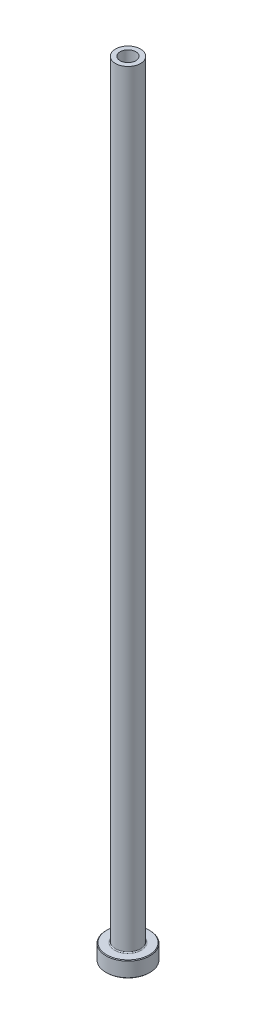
from build123d import *

# Parameters (mm, degrees)
FILLET1_R     = 0.3
CHAMFER1_SIZE = 0.2
CHAMFER3_SIZE = 0.5


with BuildPart() as part:
    # Sketch1 → Revolve1 (revolve)
    with BuildSketch(Plane.XY, mode=Mode.PRIVATE) as revolve1_sk:
        Polygon((-2.5, 250), (-4, 250), (-4, 5), (-7, 5), (-7, 0), (-2.75, 0), (-2.75, 193), (-2.5, 205), align=None)
    revolve(revolve1_sk.sketch.rotate(Axis((0, 92.187680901, 0), (0, -1, 0)), 270), axis=Axis((0, 92.187680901, 0), (0, -1, 0)))

    # Fillet1
    fillet1_edges = [part.edges().sort_by_distance(p)[0] for p in [
        (0, 5, -4),
    ]]
    fillet(fillet1_edges, radius=FILLET1_R)

    # Chamfer1
    chamfer1_edges = [part.edges().sort_by_distance(p)[0] for p in [
        (0, 0, -7),
        (0, 5, -7),
    ]]
    chamfer(chamfer1_edges, length=CHAMFER1_SIZE)

    # Chamfer3
    chamfer3_edges = [part.edges().sort_by_distance(p)[0] for p in [
        (0, 0, -2.75),
    ]]
    chamfer(chamfer3_edges, length=CHAMFER3_SIZE)


solid = part.part
